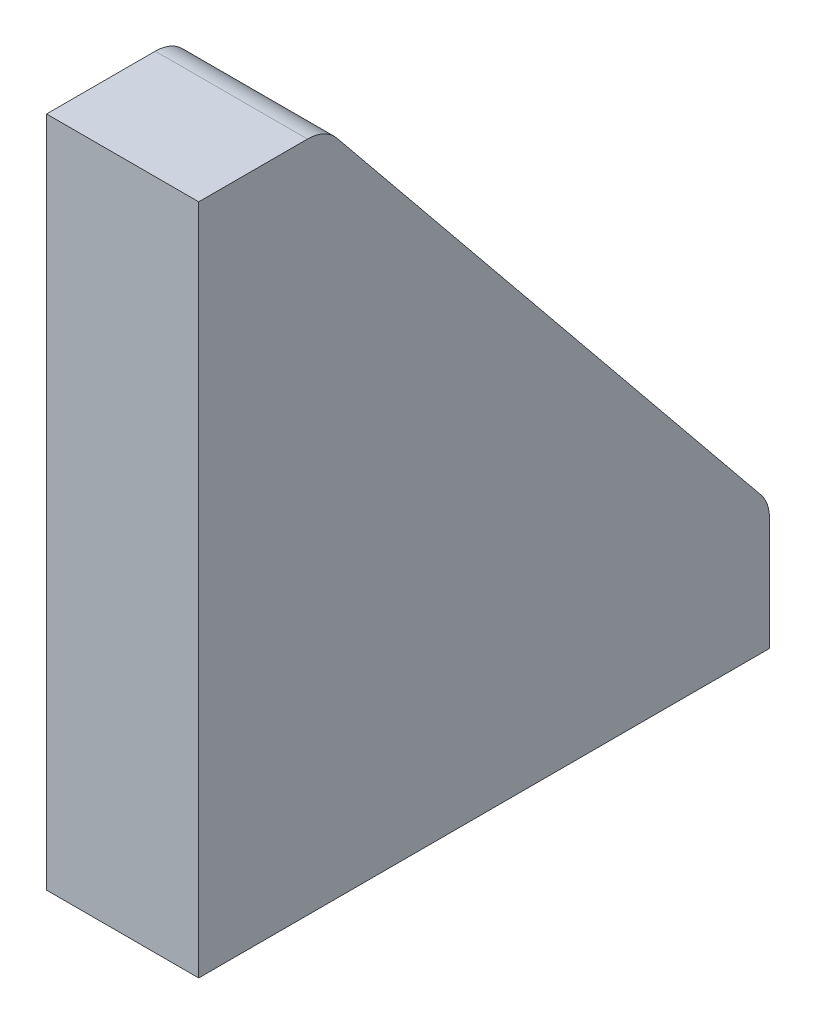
from build123d import *

# Parameters (mm, degrees)
BOSS_EXTRUDE1_DEPTH = 12


with BuildPart() as part:
    # Sketch1 → Boss-Extrude1 (new body)
    with BuildSketch(Plane(origin=(0, 0, 0), x_dir=(0, 0, -1), z_dir=(1, 0, 0))):
        with BuildLine():
            Line((45, 0), (0, 0))
            Line((0, 0), (0, 53))
            Line((0, 53), (8.573697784, 53))
            ThreePointArc((8.573697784, 53), (9.86182771, 52.709376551), (10.900383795, 51.893814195))
            Line((10.900383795, 51.893814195), (44.326686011, 10.827214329))
            ThreePointArc((44.326686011, 10.827214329), (44.826663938, 9.93837326), (45, 8.933400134))
            Line((45, 8.933400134), (45, 0))
        make_face()
    extrude(amount=BOSS_EXTRUDE1_DEPTH)


solid = part.part
